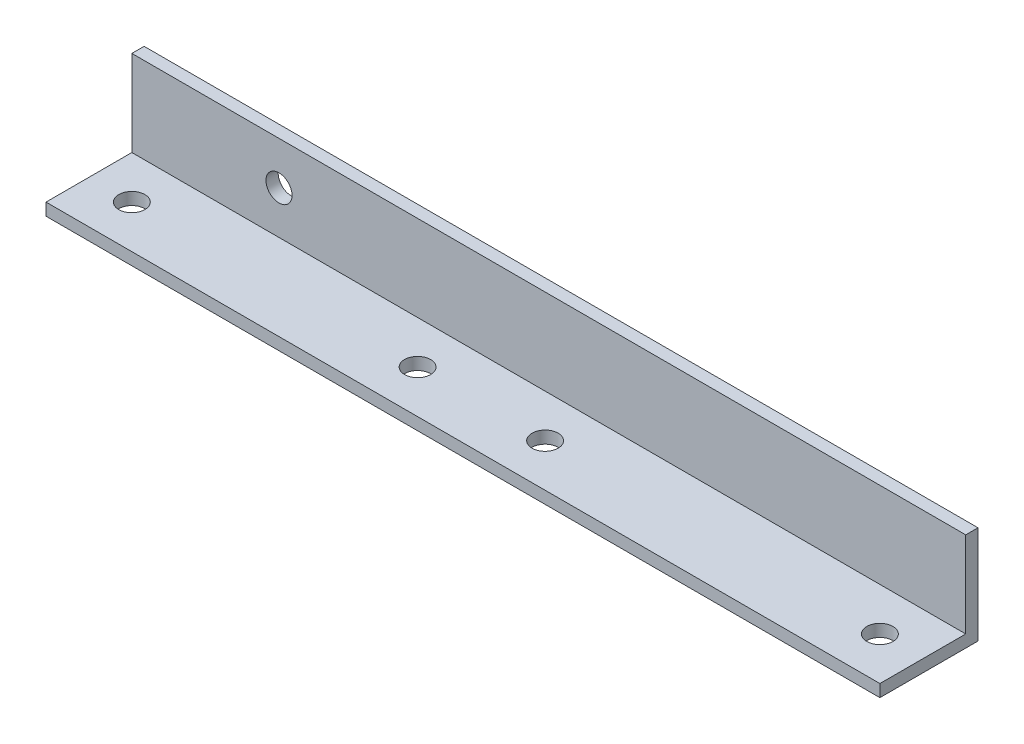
ISO-10303-21;
HEADER;
FILE_DESCRIPTION(('STEP AP214'),'2;1');
FILE_NAME('part.step','',(''),(''),'','','');
FILE_SCHEMA(('AUTOMOTIVE_DESIGN { 1 0 10303 214 1 1 1 1 }'));
ENDSEC;
DATA;
#1=APPLICATION_CONTEXT('core data for automotive mechanical design processes');
#2=APPLICATION_PROTOCOL_DEFINITION('international standard','automotive_design',2000,#1);
#3=PRODUCT_CONTEXT('',#1,'mechanical');
#4=PRODUCT('Part','Part','',(#3));
#5=PRODUCT_RELATED_PRODUCT_CATEGORY('part','',(#4));
#6=PRODUCT_DEFINITION_FORMATION('','',#4);
#7=PRODUCT_DEFINITION_CONTEXT('part definition',#1,'design');
#8=PRODUCT_DEFINITION('design','',#6,#7);
#9=PRODUCT_DEFINITION_SHAPE('','',#8);
#10=(LENGTH_UNIT() NAMED_UNIT(*) SI_UNIT(.MILLI.,.METRE.));
#11=(NAMED_UNIT(*) PLANE_ANGLE_UNIT() SI_UNIT($,.RADIAN.));
#12=(NAMED_UNIT(*) SI_UNIT($,.STERADIAN.) SOLID_ANGLE_UNIT());
#13=UNCERTAINTY_MEASURE_WITH_UNIT(LENGTH_MEASURE(1.E-05),#10,'distance_accuracy_value','');
#14=(GEOMETRIC_REPRESENTATION_CONTEXT(3) GLOBAL_UNCERTAINTY_ASSIGNED_CONTEXT((#13)) GLOBAL_UNIT_ASSIGNED_CONTEXT((#10,
#11,#12)) REPRESENTATION_CONTEXT('',''));
#15=CARTESIAN_POINT('',(0.,0.,0.));
#16=DIRECTION('',(0.,0.,1.));
#17=DIRECTION('',(1.,0.,0.));
#18=AXIS2_PLACEMENT_3D('',#15,#16,#17);
#19=CARTESIAN_POINT('',(107.95,3.175,-12.7));
#20=DIRECTION('',(-1.,0.,0.));
#21=DIRECTION('',(0.,0.,1.));
#22=AXIS2_PLACEMENT_3D('',#19,#20,#21);
#23=PLANE('',#22);
#24=DIRECTION('',(0.,0.,-1.));
#25=VECTOR('',#24,1.);
#26=CARTESIAN_POINT('',(107.95,0.,-12.7));
#27=LINE('',#26,#25);
#28=CARTESIAN_POINT('',(107.95,0.,12.7));
#29=VERTEX_POINT('',#28);
#30=CARTESIAN_POINT('',(107.95,0.,-12.7));
#31=VERTEX_POINT('',#30);
#32=EDGE_CURVE('E89',#29,#31,#27,.T.);
#33=ORIENTED_EDGE('',*,*,#32,.T.);
#34=DIRECTION('',(0.,-1.,0.));
#35=VECTOR('',#34,1.);
#36=CARTESIAN_POINT('',(107.95,3.175,-12.7));
#37=LINE('',#36,#35);
#38=CARTESIAN_POINT('',(107.95,25.4,-12.7));
#39=VERTEX_POINT('',#38);
#40=EDGE_CURVE('E11',#39,#31,#37,.T.);
#41=ORIENTED_EDGE('',*,*,#40,.F.);
#42=DIRECTION('',(0.,0.,-1.));
#43=VECTOR('',#42,1.);
#44=CARTESIAN_POINT('',(107.95,25.4,-9.525));
#45=LINE('',#44,#43);
#46=CARTESIAN_POINT('',(107.95,25.4,-9.525));
#47=VERTEX_POINT('',#46);
#48=EDGE_CURVE('E115',#47,#39,#45,.T.);
#49=ORIENTED_EDGE('',*,*,#48,.F.);
#50=DIRECTION('',(0.,-1.,0.));
#51=VECTOR('',#50,1.);
#52=CARTESIAN_POINT('',(107.95,25.4,-9.525));
#53=LINE('',#52,#51);
#54=CARTESIAN_POINT('',(107.95,3.175,-9.525));
#55=VERTEX_POINT('',#54);
#56=EDGE_CURVE('E98',#47,#55,#53,.T.);
#57=ORIENTED_EDGE('',*,*,#56,.T.);
#58=DIRECTION('',(0.,0.,-1.));
#59=VECTOR('',#58,1.);
#60=CARTESIAN_POINT('',(107.95,3.175,-12.7));
#61=LINE('',#60,#59);
#62=CARTESIAN_POINT('',(107.95,3.175,12.7));
#63=VERTEX_POINT('',#62);
#64=EDGE_CURVE('E83',#63,#55,#61,.T.);
#65=ORIENTED_EDGE('',*,*,#64,.F.);
#66=DIRECTION('',(0.,-1.,0.));
#67=VECTOR('',#66,1.);
#68=CARTESIAN_POINT('',(107.95,3.175,12.7));
#69=LINE('',#68,#67);
#70=EDGE_CURVE('E76',#63,#29,#69,.T.);
#71=ORIENTED_EDGE('',*,*,#70,.T.);
#72=EDGE_LOOP('',(#33,#41,#49,#57,#65,#71));
#73=FACE_BOUND('',#72,.T.);
#74=ADVANCED_FACE('F32',(#73),#23,.F.);
#75=CARTESIAN_POINT('',(-107.95,3.175,-12.7));
#76=DIRECTION('',(0.,0.,1.));
#77=DIRECTION('',(1.,0.,0.));
#78=AXIS2_PLACEMENT_3D('',#75,#76,#77);
#79=PLANE('',#78);
#80=CARTESIAN_POINT('',(-69.8500000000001,14.2875,-12.7));
#81=DIRECTION('',(0.,0.,1.));
#82=DIRECTION('',(1.,0.,0.));
#83=AXIS2_PLACEMENT_3D('',#80,#81,#82);
#84=CIRCLE('',#83,3.37819999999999);
#85=CARTESIAN_POINT('',(-66.4718000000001,14.2875,-12.7));
#86=VERTEX_POINT('',#85);
#87=EDGE_CURVE('E159',#86,#86,#84,.T.);
#88=ORIENTED_EDGE('',*,*,#87,.T.);
#89=EDGE_LOOP('',(#88));
#90=FACE_BOUND('',#89,.T.);
#91=DIRECTION('',(-1.,0.,0.));
#92=VECTOR('',#91,1.);
#93=CARTESIAN_POINT('',(-107.95,0.,-12.7));
#94=LINE('',#93,#92);
#95=CARTESIAN_POINT('',(-107.95,0.,-12.7));
#96=VERTEX_POINT('',#95);
#97=EDGE_CURVE('E93',#31,#96,#94,.T.);
#98=ORIENTED_EDGE('',*,*,#97,.T.);
#99=DIRECTION('',(0.,-1.,0.));
#100=VECTOR('',#99,1.);
#101=CARTESIAN_POINT('',(-107.95,3.175,-12.7));
#102=LINE('',#101,#100);
#103=CARTESIAN_POINT('',(-107.95,25.4,-12.7));
#104=VERTEX_POINT('',#103);
#105=EDGE_CURVE('E40',#104,#96,#102,.T.);
#106=ORIENTED_EDGE('',*,*,#105,.F.);
#107=DIRECTION('',(-1.,0.,0.));
#108=VECTOR('',#107,1.);
#109=CARTESIAN_POINT('',(107.95,25.4,-12.7));
#110=LINE('',#109,#108);
#111=EDGE_CURVE('E118',#39,#104,#110,.T.);
#112=ORIENTED_EDGE('',*,*,#111,.F.);
#113=ORIENTED_EDGE('',*,*,#40,.T.);
#114=EDGE_LOOP('',(#98,#106,#112,#113));
#115=FACE_BOUND('',#114,.T.);
#116=ADVANCED_FACE('F168',(#90,#115),#79,.F.);
#117=CARTESIAN_POINT('',(-107.95,3.175,-12.7));
#118=DIRECTION('',(1.,0.,0.));
#119=DIRECTION('',(0.,0.,-1.));
#120=AXIS2_PLACEMENT_3D('',#117,#118,#119);
#121=PLANE('',#120);
#122=DIRECTION('',(0.,0.,1.));
#123=VECTOR('',#122,1.);
#124=CARTESIAN_POINT('',(-107.95,0.,-12.7));
#125=LINE('',#124,#123);
#126=CARTESIAN_POINT('',(-107.95,0.,12.7));
#127=VERTEX_POINT('',#126);
#128=EDGE_CURVE('E84',#96,#127,#125,.T.);
#129=ORIENTED_EDGE('',*,*,#128,.T.);
#130=DIRECTION('',(0.,-1.,0.));
#131=VECTOR('',#130,1.);
#132=CARTESIAN_POINT('',(-107.95,3.175,12.7));
#133=LINE('',#132,#131);
#134=CARTESIAN_POINT('',(-107.95,3.175,12.7));
#135=VERTEX_POINT('',#134);
#136=EDGE_CURVE('E79',#135,#127,#133,.T.);
#137=ORIENTED_EDGE('',*,*,#136,.F.);
#138=DIRECTION('',(0.,0.,1.));
#139=VECTOR('',#138,1.);
#140=CARTESIAN_POINT('',(-107.95,3.175,-12.7));
#141=LINE('',#140,#139);
#142=CARTESIAN_POINT('',(-107.95,3.175,-9.525));
#143=VERTEX_POINT('',#142);
#144=EDGE_CURVE('E108',#143,#135,#141,.T.);
#145=ORIENTED_EDGE('',*,*,#144,.F.);
#146=DIRECTION('',(0.,-1.,0.));
#147=VECTOR('',#146,1.);
#148=CARTESIAN_POINT('',(-107.95,25.4,-9.525));
#149=LINE('',#148,#147);
#150=CARTESIAN_POINT('',(-107.95,25.4,-9.525));
#151=VERTEX_POINT('',#150);
#152=EDGE_CURVE('E94',#151,#143,#149,.T.);
#153=ORIENTED_EDGE('',*,*,#152,.F.);
#154=DIRECTION('',(0.,0.,1.));
#155=VECTOR('',#154,1.);
#156=CARTESIAN_POINT('',(-107.95,25.4,-12.7));
#157=LINE('',#156,#155);
#158=EDGE_CURVE('E131',#104,#151,#157,.T.);
#159=ORIENTED_EDGE('',*,*,#158,.F.);
#160=ORIENTED_EDGE('',*,*,#105,.T.);
#161=EDGE_LOOP('',(#129,#137,#145,#153,#159,#160));
#162=FACE_BOUND('',#161,.T.);
#163=ADVANCED_FACE('F193',(#162),#121,.F.);
#164=CARTESIAN_POINT('',(-107.95,3.175,12.7));
#165=DIRECTION('',(0.,0.,-1.));
#166=DIRECTION('',(-1.,0.,0.));
#167=AXIS2_PLACEMENT_3D('',#164,#165,#166);
#168=PLANE('',#167);
#169=DIRECTION('',(1.,0.,0.));
#170=VECTOR('',#169,1.);
#171=CARTESIAN_POINT('',(-107.95,0.,12.7));
#172=LINE('',#171,#170);
#173=EDGE_CURVE('E73',#127,#29,#172,.T.);
#174=ORIENTED_EDGE('',*,*,#173,.T.);
#175=ORIENTED_EDGE('',*,*,#70,.F.);
#176=DIRECTION('',(1.,0.,0.));
#177=VECTOR('',#176,1.);
#178=CARTESIAN_POINT('',(-107.95,3.175,12.7));
#179=LINE('',#178,#177);
#180=EDGE_CURVE('E54',#135,#63,#179,.T.);
#181=ORIENTED_EDGE('',*,*,#180,.F.);
#182=ORIENTED_EDGE('',*,*,#136,.T.);
#183=EDGE_LOOP('',(#174,#175,#181,#182));
#184=FACE_BOUND('',#183,.T.);
#185=ADVANCED_FACE('F75',(#184),#168,.F.);
#186=CARTESIAN_POINT('',(107.95,3.175,12.7));
#187=DIRECTION('',(0.,1.,0.));
#188=DIRECTION('',(0.,0.,1.));
#189=AXIS2_PLACEMENT_3D('',#186,#187,#188);
#190=PLANE('',#189);
#191=CARTESIAN_POINT('',(-22.8600000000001,3.175,1.5875));
#192=DIRECTION('',(0.,1.,0.));
#193=DIRECTION('',(0.,0.,1.));
#194=AXIS2_PLACEMENT_3D('',#191,#192,#193);
#195=CIRCLE('',#194,3.3782);
#196=CARTESIAN_POINT('',(-22.8600000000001,3.175,4.9657));
#197=VERTEX_POINT('',#196);
#198=EDGE_CURVE('E156',#197,#197,#195,.T.);
#199=ORIENTED_EDGE('',*,*,#198,.F.);
#200=EDGE_LOOP('',(#199));
#201=FACE_BOUND('',#200,.T.);
#202=CARTESIAN_POINT('',(96.8374999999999,3.175,1.5875));
#203=DIRECTION('',(0.,1.,0.));
#204=DIRECTION('',(0.,0.,1.));
#205=AXIS2_PLACEMENT_3D('',#202,#203,#204);
#206=CIRCLE('',#205,3.37819999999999);
#207=CARTESIAN_POINT('',(96.8374999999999,3.175,4.96569999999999));
#208=VERTEX_POINT('',#207);
#209=EDGE_CURVE('E150',#208,#208,#206,.T.);
#210=ORIENTED_EDGE('',*,*,#209,.F.);
#211=EDGE_LOOP('',(#210));
#212=FACE_BOUND('',#211,.T.);
#213=CARTESIAN_POINT('',(10.1599999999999,3.175,1.5875));
#214=DIRECTION('',(0.,1.,0.));
#215=DIRECTION('',(0.,0.,1.));
#216=AXIS2_PLACEMENT_3D('',#213,#214,#215);
#217=CIRCLE('',#216,3.3782);
#218=CARTESIAN_POINT('',(10.1599999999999,3.175,4.9657));
#219=VERTEX_POINT('',#218);
#220=EDGE_CURVE('E144',#219,#219,#217,.T.);
#221=ORIENTED_EDGE('',*,*,#220,.F.);
#222=EDGE_LOOP('',(#221));
#223=FACE_BOUND('',#222,.T.);
#224=CARTESIAN_POINT('',(-96.8375,3.175,1.5875));
#225=DIRECTION('',(0.,1.,0.));
#226=DIRECTION('',(0.,0.,1.));
#227=AXIS2_PLACEMENT_3D('',#224,#225,#226);
#228=CIRCLE('',#227,3.37819999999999);
#229=CARTESIAN_POINT('',(-96.8375,3.175,4.96569999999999));
#230=VERTEX_POINT('',#229);
#231=EDGE_CURVE('E138',#230,#230,#228,.T.);
#232=ORIENTED_EDGE('',*,*,#231,.F.);
#233=EDGE_LOOP('',(#232));
#234=FACE_BOUND('',#233,.T.);
#235=DIRECTION('',(1.,0.,0.));
#236=VECTOR('',#235,1.);
#237=CARTESIAN_POINT('',(-107.95,3.175,-9.525));
#238=LINE('',#237,#236);
#239=EDGE_CURVE('E48',#143,#55,#238,.T.);
#240=ORIENTED_EDGE('',*,*,#239,.F.);
#241=ORIENTED_EDGE('',*,*,#144,.T.);
#242=ORIENTED_EDGE('',*,*,#180,.T.);
#243=ORIENTED_EDGE('',*,*,#64,.T.);
#244=EDGE_LOOP('',(#240,#241,#242,#243));
#245=FACE_BOUND('',#244,.T.);
#246=ADVANCED_FACE('F194',(#201,#212,#223,#234,#245),#190,.T.);
#247=CARTESIAN_POINT('',(107.95,0.,12.7));
#248=DIRECTION('',(0.,1.,0.));
#249=DIRECTION('',(0.,0.,1.));
#250=AXIS2_PLACEMENT_3D('',#247,#248,#249);
#251=PLANE('',#250);
#252=CARTESIAN_POINT('',(-22.8600000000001,0.,1.5875));
#253=DIRECTION('',(0.,1.,0.));
#254=DIRECTION('',(0.,0.,1.));
#255=AXIS2_PLACEMENT_3D('',#252,#253,#254);
#256=CIRCLE('',#255,3.3782);
#257=CARTESIAN_POINT('',(-22.8600000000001,0.,4.9657));
#258=VERTEX_POINT('',#257);
#259=EDGE_CURVE('E153',#258,#258,#256,.T.);
#260=ORIENTED_EDGE('',*,*,#259,.T.);
#261=EDGE_LOOP('',(#260));
#262=FACE_BOUND('',#261,.T.);
#263=CARTESIAN_POINT('',(96.8374999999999,0.,1.5875));
#264=DIRECTION('',(0.,1.,0.));
#265=DIRECTION('',(0.,0.,1.));
#266=AXIS2_PLACEMENT_3D('',#263,#264,#265);
#267=CIRCLE('',#266,3.37819999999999);
#268=CARTESIAN_POINT('',(96.8374999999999,0.,4.96569999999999));
#269=VERTEX_POINT('',#268);
#270=EDGE_CURVE('E147',#269,#269,#267,.T.);
#271=ORIENTED_EDGE('',*,*,#270,.T.);
#272=EDGE_LOOP('',(#271));
#273=FACE_BOUND('',#272,.T.);
#274=CARTESIAN_POINT('',(10.1599999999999,0.,1.5875));
#275=DIRECTION('',(0.,1.,0.));
#276=DIRECTION('',(0.,0.,1.));
#277=AXIS2_PLACEMENT_3D('',#274,#275,#276);
#278=CIRCLE('',#277,3.3782);
#279=CARTESIAN_POINT('',(10.1599999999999,0.,4.9657));
#280=VERTEX_POINT('',#279);
#281=EDGE_CURVE('E141',#280,#280,#278,.T.);
#282=ORIENTED_EDGE('',*,*,#281,.T.);
#283=EDGE_LOOP('',(#282));
#284=FACE_BOUND('',#283,.T.);
#285=CARTESIAN_POINT('',(-96.8375,0.,1.5875));
#286=DIRECTION('',(0.,1.,0.));
#287=DIRECTION('',(0.,0.,1.));
#288=AXIS2_PLACEMENT_3D('',#285,#286,#287);
#289=CIRCLE('',#288,3.37819999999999);
#290=CARTESIAN_POINT('',(-96.8375,0.,4.96569999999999));
#291=VERTEX_POINT('',#290);
#292=EDGE_CURVE('E119',#291,#291,#289,.T.);
#293=ORIENTED_EDGE('',*,*,#292,.T.);
#294=EDGE_LOOP('',(#293));
#295=FACE_BOUND('',#294,.T.);
#296=ORIENTED_EDGE('',*,*,#32,.F.);
#297=ORIENTED_EDGE('',*,*,#173,.F.);
#298=ORIENTED_EDGE('',*,*,#128,.F.);
#299=ORIENTED_EDGE('',*,*,#97,.F.);
#300=EDGE_LOOP('',(#296,#297,#298,#299));
#301=FACE_BOUND('',#300,.T.);
#302=ADVANCED_FACE('F92',(#262,#273,#284,#295,#301),#251,.F.);
#303=CARTESIAN_POINT('',(-107.95,25.4,-9.525));
#304=DIRECTION('',(0.,0.,-1.));
#305=DIRECTION('',(-1.,0.,0.));
#306=AXIS2_PLACEMENT_3D('',#303,#304,#305);
#307=PLANE('',#306);
#308=CARTESIAN_POINT('',(-69.8500000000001,14.2875,-9.525));
#309=DIRECTION('',(0.,0.,1.));
#310=DIRECTION('',(1.,0.,0.));
#311=AXIS2_PLACEMENT_3D('',#308,#309,#310);
#312=CIRCLE('',#311,3.37819999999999);
#313=CARTESIAN_POINT('',(-66.4718000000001,14.2875,-9.525));
#314=VERTEX_POINT('',#313);
#315=EDGE_CURVE('E162',#314,#314,#312,.T.);
#316=ORIENTED_EDGE('',*,*,#315,.F.);
#317=EDGE_LOOP('',(#316));
#318=FACE_BOUND('',#317,.T.);
#319=ORIENTED_EDGE('',*,*,#239,.T.);
#320=ORIENTED_EDGE('',*,*,#56,.F.);
#321=DIRECTION('',(1.,0.,0.));
#322=VECTOR('',#321,1.);
#323=CARTESIAN_POINT('',(-107.95,25.4,-9.525));
#324=LINE('',#323,#322);
#325=EDGE_CURVE('E126',#151,#47,#324,.T.);
#326=ORIENTED_EDGE('',*,*,#325,.F.);
#327=ORIENTED_EDGE('',*,*,#152,.T.);
#328=EDGE_LOOP('',(#319,#320,#326,#327));
#329=FACE_BOUND('',#328,.T.);
#330=ADVANCED_FACE('F178',(#318,#329),#307,.F.);
#331=CARTESIAN_POINT('',(-107.95,25.4,-12.7));
#332=DIRECTION('',(0.,1.,0.));
#333=DIRECTION('',(0.,0.,1.));
#334=AXIS2_PLACEMENT_3D('',#331,#332,#333);
#335=PLANE('',#334);
#336=ORIENTED_EDGE('',*,*,#111,.T.);
#337=ORIENTED_EDGE('',*,*,#158,.T.);
#338=ORIENTED_EDGE('',*,*,#325,.T.);
#339=ORIENTED_EDGE('',*,*,#48,.T.);
#340=EDGE_LOOP('',(#336,#337,#338,#339));
#341=FACE_BOUND('',#340,.T.);
#342=ADVANCED_FACE('F181',(#341),#335,.T.);
#343=CARTESIAN_POINT('',(-96.8375,0.,1.5875));
#344=DIRECTION('',(0.,1.,0.));
#345=DIRECTION('',(0.,0.,1.));
#346=AXIS2_PLACEMENT_3D('',#343,#344,#345);
#347=CYLINDRICAL_SURFACE('',#346,3.37819999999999);
#348=ORIENTED_EDGE('',*,*,#292,.F.);
#349=EDGE_LOOP('',(#348));
#350=FACE_BOUND('',#349,.T.);
#351=ORIENTED_EDGE('',*,*,#231,.T.);
#352=EDGE_LOOP('',(#351));
#353=FACE_BOUND('',#352,.T.);
#354=ADVANCED_FACE('F262',(#350,#353),#347,.F.);
#355=CARTESIAN_POINT('',(10.1599999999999,0.,1.5875));
#356=DIRECTION('',(0.,1.,0.));
#357=DIRECTION('',(0.,0.,1.));
#358=AXIS2_PLACEMENT_3D('',#355,#356,#357);
#359=CYLINDRICAL_SURFACE('',#358,3.3782);
#360=ORIENTED_EDGE('',*,*,#281,.F.);
#361=EDGE_LOOP('',(#360));
#362=FACE_BOUND('',#361,.T.);
#363=ORIENTED_EDGE('',*,*,#220,.T.);
#364=EDGE_LOOP('',(#363));
#365=FACE_BOUND('',#364,.T.);
#366=ADVANCED_FACE('F270',(#362,#365),#359,.F.);
#367=CARTESIAN_POINT('',(96.8374999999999,0.,1.5875));
#368=DIRECTION('',(0.,1.,0.));
#369=DIRECTION('',(0.,0.,1.));
#370=AXIS2_PLACEMENT_3D('',#367,#368,#369);
#371=CYLINDRICAL_SURFACE('',#370,3.37819999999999);
#372=ORIENTED_EDGE('',*,*,#270,.F.);
#373=EDGE_LOOP('',(#372));
#374=FACE_BOUND('',#373,.T.);
#375=ORIENTED_EDGE('',*,*,#209,.T.);
#376=EDGE_LOOP('',(#375));
#377=FACE_BOUND('',#376,.T.);
#378=ADVANCED_FACE('F279',(#374,#377),#371,.F.);
#379=CARTESIAN_POINT('',(-22.8600000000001,0.,1.5875));
#380=DIRECTION('',(0.,1.,0.));
#381=DIRECTION('',(0.,0.,1.));
#382=AXIS2_PLACEMENT_3D('',#379,#380,#381);
#383=CYLINDRICAL_SURFACE('',#382,3.3782);
#384=ORIENTED_EDGE('',*,*,#259,.F.);
#385=EDGE_LOOP('',(#384));
#386=FACE_BOUND('',#385,.T.);
#387=ORIENTED_EDGE('',*,*,#198,.T.);
#388=EDGE_LOOP('',(#387));
#389=FACE_BOUND('',#388,.T.);
#390=ADVANCED_FACE('F174',(#386,#389),#383,.F.);
#391=CARTESIAN_POINT('',(-69.8500000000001,14.2875,-12.7));
#392=DIRECTION('',(0.,0.,1.));
#393=DIRECTION('',(1.,0.,0.));
#394=AXIS2_PLACEMENT_3D('',#391,#392,#393);
#395=CYLINDRICAL_SURFACE('',#394,3.37819999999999);
#396=ORIENTED_EDGE('',*,*,#87,.F.);
#397=EDGE_LOOP('',(#396));
#398=FACE_BOUND('',#397,.T.);
#399=ORIENTED_EDGE('',*,*,#315,.T.);
#400=EDGE_LOOP('',(#399));
#401=FACE_BOUND('',#400,.T.);
#402=ADVANCED_FACE('F171',(#398,#401),#395,.F.);
#403=CLOSED_SHELL('',(#74,#116,#163,#185,#246,#302,#330,#342,#354,#366,#378,#390,#402));
#404=MANIFOLD_SOLID_BREP('B2',#403);
#405=ADVANCED_BREP_SHAPE_REPRESENTATION('',(#18,#404),#14);
#406=SHAPE_DEFINITION_REPRESENTATION(#9,#405);
ENDSEC;
END-ISO-10303-21;
